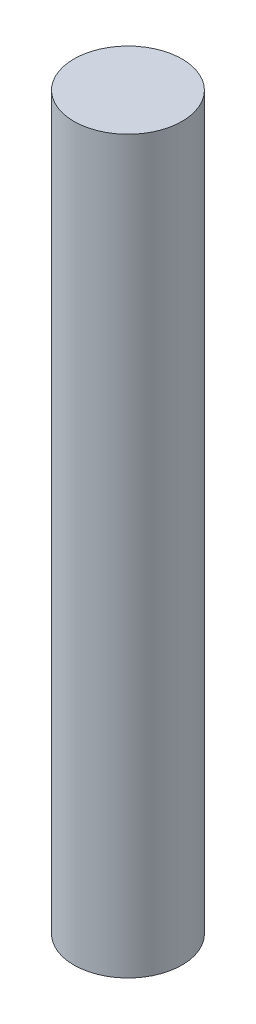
from build123d import *

# Parameters (mm, degrees)
SKETCH1_R           = 1.85
BOSS_EXTRUDE1_DEPTH = 25


with BuildPart() as part:
    # Sketch1 → Boss-Extrude1 (new body)
    with BuildSketch(Plane(origin=(0, 0, 0), x_dir=(1, 0, 0), z_dir=(0, 1, 0))):
        with Locations(Location((0, 0, 0), (0, 0, 270))):
            Circle(SKETCH1_R)
    extrude(amount=BOSS_EXTRUDE1_DEPTH)


solid = part.part
